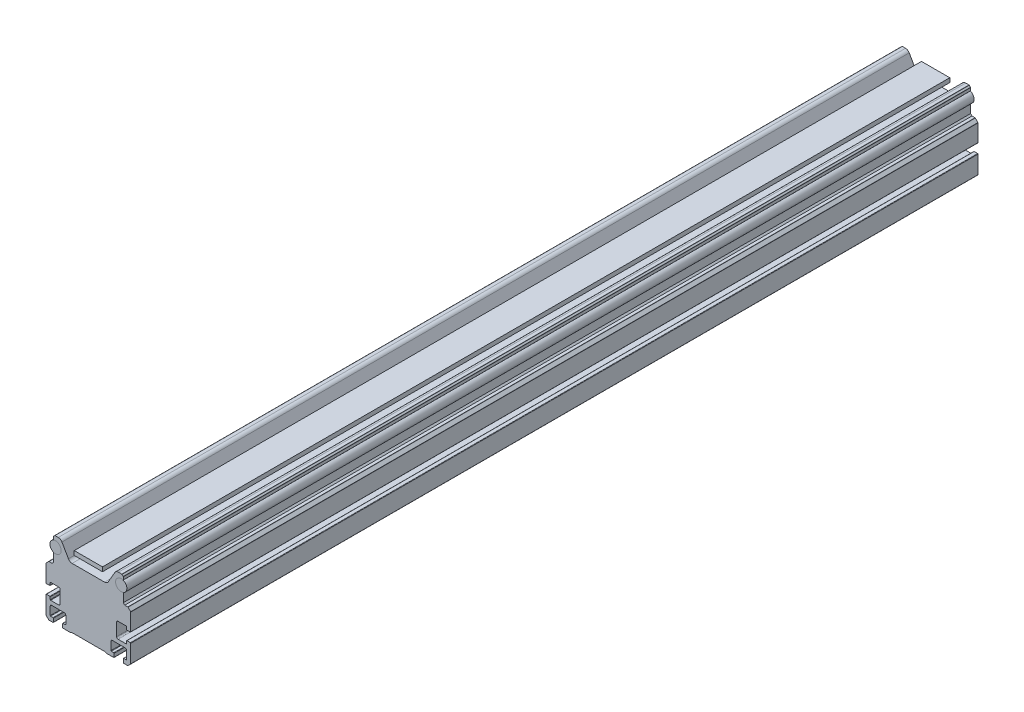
from build123d import *

# Parameters (mm, degrees)
EXTRUDE_1_DEPTH     = 600
SKETCH_1_W          = 20
SKETCH_1_H          = 3
EXTRUDE_1_2_DEPTH   = 600
SKETCH_2_W          = 45.499999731
SKETCH_2_H          = 14.250000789
SKETCH_2_W_2        = 28.000000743
SKETCH_2_H_2        = 22.250001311
CUT_EXTRUDE_1_DEPTH = 645.974738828
SKETCH_3_R          = 4
CUT_EXTRUDE_2_DEPTH = 645.974738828
SKETCH_4_W          = 55.999998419
SKETCH_4_H          = 7.249997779
SKETCH_4_W_2        = 36.000000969
SKETCH_4_H_2        = 12.750001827
CUT_EXTRUDE_3_DEPTH = 645.974738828
FILLET_1_R          = 3
FILLET_2_R          = 2
FILLET_3_R          = 1
SKETCH_5_W          = 7
SKETCH_5_H          = 5.7
SKETCH_5_W_2        = 6.5
SKETCH_5_H_2        = 6
EXTRUDE_2_DEPTH     = 600
SKETCH_6_R          = 2.1
CUT_EXTRUDE_4_DEPTH = 645.974738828
CUT_EXTRUDE_5_DEPTH = 645.974738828
FILLET_4_R          = 2
FILLET_5_R          = 0.5
SKETCH_8_R          = 4
EXTRUDE_3_DEPTH     = 600
EXTRUDE_3_2_DEPTH   = 600
EXTRUDE_4_DEPTH     = 600


with BuildPart() as part:
    # Sketch 1 → Extrude 1 (new body)
    with BuildSketch(Plane.XY):
        with BuildLine():
            Line((145.211893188, 91.381442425), (168.963364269, 91.381442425))
            ThreePointArc((168.963364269, 91.381442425), (169.078169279, 91.358606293), (169.175496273, 91.29357449))
            Line((169.175496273, 91.29357449), (169.499760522, 90.969310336))
            ThreePointArc((169.499760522, 90.969310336), (169.597087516, 90.904278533), (169.711892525, 90.881442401))
            Line((169.711892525, 90.881442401), (175.03762846, 90.881442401))
            ThreePointArc((175.03762846, 90.881442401), (175.249760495, 90.969310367), (175.33762846, 91.181442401))
            Line((175.33762846, 91.181442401), (175.33762846, 93.581442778))
            ThreePointArc((175.33762846, 93.581442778), (175.249760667, 93.79357499), (175.037628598, 93.881443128))
            Line((175.037628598, 93.881443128), (173.387629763, 93.881443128))
            ThreePointArc((173.387629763, 93.881443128), (173.175497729, 93.969311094), (173.087629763, 94.181443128))
            Line((173.087629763, 94.181443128), (173.087629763, 99.881442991))
            ThreePointArc((173.087629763, 99.881442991), (173.380522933, 100.588549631), (174.087629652, 100.881442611))
            Line((174.087629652, 100.881442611), (183.087629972, 100.881442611))
            ThreePointArc((183.087629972, 100.881442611), (183.794736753, 100.588549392), (184.087629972, 99.881442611))
            Line((184.087629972, 99.881442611), (184.087629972, 94.18144286))
            ThreePointArc((184.087629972, 94.18144286), (183.999762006, 93.969310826), (183.787629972, 93.88144286))
            Line((183.787629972, 93.88144286), (182.137629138, 93.88144286))
            ThreePointArc((182.137629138, 93.88144286), (181.925497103, 93.793574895), (181.837629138, 93.58144286))
            Line((181.837629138, 93.58144286), (181.837629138, 91.181442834))
            ThreePointArc((181.837629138, 91.181442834), (181.925497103, 90.9693108), (182.137629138, 90.881442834))
            Line((182.137629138, 90.881442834), (184.963364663, 90.881442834))
            ThreePointArc((184.963364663, 90.881442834), (185.078169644, 90.904278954), (185.175496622, 90.969310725))
            Line((185.175496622, 90.969310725), (186.999760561, 92.793573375))
            ThreePointArc((186.999760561, 92.793573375), (187.064792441, 92.890900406), (187.087628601, 93.005705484))
            Line((187.087628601, 93.005705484), (187.087628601, 105.581442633))
            ThreePointArc((187.087628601, 105.581442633), (186.999760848, 105.793574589), (186.787629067, 105.881442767))
            Line((186.787629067, 105.881442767), (184.387630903, 105.881442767))
            ThreePointArc((184.387630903, 105.881442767), (184.175498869, 105.793574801), (184.087630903, 105.581442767))
            Line((184.087630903, 105.581442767), (184.087630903, 103.931442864))
            ThreePointArc((184.087630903, 103.931442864), (183.999762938, 103.71931083), (183.787630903, 103.631442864))
            Line((183.787630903, 103.631442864), (178.087629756, 103.631442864))
            ThreePointArc((178.087629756, 103.631442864), (177.380522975, 103.924336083), (177.087629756, 104.631442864))
            Line((177.087629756, 104.631442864), (177.087629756, 113.63144305))
            ThreePointArc((177.087629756, 113.63144305), (177.380522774, 114.338550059), (178.08762951, 114.631443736))
            Line((178.08762951, 114.631443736), (183.787629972, 114.631443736))
            ThreePointArc((183.787629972, 114.631443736), (183.999762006, 114.54357577), (184.087629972, 114.331443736))
            Line((184.087629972, 114.331443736), (184.087629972, 112.681444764))
            ThreePointArc((184.087629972, 112.681444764), (184.175497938, 112.46931273), (184.387629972, 112.381444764))
            Line((184.387629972, 112.381444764), (186.787628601, 112.381444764))
            ThreePointArc((186.787628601, 112.381444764), (186.999760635, 112.46931273), (187.087628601, 112.681444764))
            Line((187.087628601, 112.681444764), (187.087628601, 124.757179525))
            ThreePointArc((187.087628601, 124.757179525), (187.064792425, 124.871984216), (186.999760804, 124.969310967))
            Line((186.999760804, 124.969310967), (185.175500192, 126.793573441))
            ThreePointArc((185.175500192, 126.793573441), (185.07817315, 126.858605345), (184.96336805, 126.881441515))
            Line((184.96336805, 126.881441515), (182.837631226, 126.881441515))
            Line((182.837631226, 126.881441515), (181.837629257, 127.881445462))
            Line((181.837629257, 127.881445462), (181.837629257, 133.887697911))
            ThreePointArc((181.837629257, 133.887697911), (181.75514319, 134.049532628), (181.575724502, 134.077876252))
            ThreePointArc((181.575724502, 134.077876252), (184.337629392, 137.881443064), (181.575724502, 141.685009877))
            ThreePointArc((181.575724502, 141.685009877), (181.75514319, 141.713353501), (181.837629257, 141.875188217))
            Line((181.837629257, 141.875188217), (181.837629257, 143.75717837))
            ThreePointArc((181.837629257, 143.75717837), (181.814793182, 143.871983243), (181.749761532, 143.969310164))
            Line((181.749761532, 143.969310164), (180.925497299, 144.79357626))
            ThreePointArc((180.925497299, 144.79357626), (180.828170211, 144.85860826), (180.713365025, 144.881444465))
            Line((180.713365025, 144.881444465), (178.402586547, 144.881444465))
            ThreePointArc((178.402586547, 144.881444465), (176.902586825, 144.479520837), (175.804510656, 143.38144502))
            Line((175.804510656, 143.38144502), (171.185705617, 135.381443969))
            ThreePointArc((171.185705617, 135.381443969), (170.087629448, 134.283368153), (168.587629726, 133.881444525))
            Line((168.587629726, 133.881444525), (145.587629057, 133.881444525))
            ThreePointArc((145.587629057, 133.881444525), (144.087629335, 134.283368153), (142.989553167, 135.381443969))
            Line((142.989553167, 135.381443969), (138.370748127, 143.38144502))
            ThreePointArc((138.370748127, 143.38144502), (137.272671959, 144.479520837), (135.772672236, 144.881444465))
            Line((135.772672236, 144.881444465), (133.461893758, 144.881444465))
            ThreePointArc((133.461893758, 144.881444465), (133.347088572, 144.85860826), (133.249761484, 144.79357626))
            Line((133.249761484, 144.79357626), (132.425497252, 143.969310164))
            ThreePointArc((132.425497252, 143.969310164), (132.360465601, 143.871983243), (132.337629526, 143.75717837))
            Line((132.337629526, 143.75717837), (132.337629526, 141.875188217))
            ThreePointArc((132.337629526, 141.875188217), (132.420115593, 141.713353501), (132.599534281, 141.685009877))
            ThreePointArc((132.599534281, 141.685009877), (129.837629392, 137.881443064), (132.599534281, 134.077876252))
            ThreePointArc((132.599534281, 134.077876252), (132.420115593, 134.049532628), (132.337629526, 133.887697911))
            Line((132.337629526, 133.887697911), (132.337629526, 127.881445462))
            Line((132.337629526, 127.881445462), (131.337627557, 126.881441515))
            Line((131.337627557, 126.881441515), (129.211890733, 126.881441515))
            ThreePointArc((129.211890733, 126.881441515), (129.097085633, 126.858605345), (128.999758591, 126.793573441))
            Line((128.999758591, 126.793573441), (127.175497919, 124.969310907))
            ThreePointArc((127.175497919, 124.969310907), (127.110466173, 124.87198394), (127.087630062, 124.757178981))
            Line((127.087630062, 124.757178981), (127.087630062, 112.681443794))
            ThreePointArc((127.087630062, 112.681443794), (127.175498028, 112.46931176), (127.387630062, 112.381443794))
            Line((127.387630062, 112.381443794), (129.787628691, 112.381443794))
            ThreePointArc((129.787628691, 112.381443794), (129.999760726, 112.46931176), (130.087628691, 112.681443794))
            Line((130.087628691, 112.681443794), (130.087628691, 114.331442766))
            ThreePointArc((130.087628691, 114.331442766), (130.175496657, 114.543574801), (130.387628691, 114.631442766))
            Line((130.387628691, 114.631442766), (136.087629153, 114.631442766))
            ThreePointArc((136.087629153, 114.631442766), (136.794735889, 114.338549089), (137.087628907, 113.631442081))
            Line((137.087628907, 113.631442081), (137.087628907, 104.631441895))
            ThreePointArc((137.087628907, 104.631441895), (136.794735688, 103.924335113), (136.087628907, 103.631441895))
            Line((136.087628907, 103.631441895), (130.38762776, 103.631441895))
            ThreePointArc((130.38762776, 103.631441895), (130.175495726, 103.71930986), (130.08762776, 103.931441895))
            Line((130.08762776, 103.931441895), (130.08762776, 105.581441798))
            ThreePointArc((130.08762776, 105.581441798), (129.999759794, 105.793573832), (129.78762776, 105.881441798))
            Line((129.78762776, 105.881441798), (127.387629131, 105.881441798))
            ThreePointArc((127.387629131, 105.881441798), (127.175497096, 105.793573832), (127.087629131, 105.581441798))
            Line((127.087629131, 105.581441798), (127.087629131, 93.005704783))
            ThreePointArc((127.087629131, 93.005704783), (127.110465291, 92.890899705), (127.175497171, 92.793572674))
            Line((127.175497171, 92.793572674), (128.99976111, 90.969310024))
            ThreePointArc((128.99976111, 90.969310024), (129.097088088, 90.904278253), (129.211893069, 90.881442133))
            Line((129.211893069, 90.881442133), (132.037628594, 90.881442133))
            ThreePointArc((132.037628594, 90.881442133), (132.249760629, 90.969310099), (132.337628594, 91.181442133))
            Line((132.337628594, 91.181442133), (132.337628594, 93.581442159))
            ThreePointArc((132.337628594, 93.581442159), (132.249760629, 93.793574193), (132.037628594, 93.881442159))
            Line((132.037628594, 93.881442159), (130.38762776, 93.881442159))
            ThreePointArc((130.38762776, 93.881442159), (130.175495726, 93.969310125), (130.08762776, 94.181442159))
            Line((130.08762776, 94.181442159), (130.08762776, 99.881441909))
            ThreePointArc((130.08762776, 99.881441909), (130.380520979, 100.588548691), (131.08762776, 100.881441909))
            Line((131.08762776, 100.881441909), (140.08762808, 100.881441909))
            ThreePointArc((140.08762808, 100.881441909), (140.794734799, 100.588548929), (141.087627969, 99.881442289))
            Line((141.087627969, 99.881442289), (141.087627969, 94.181442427))
            ThreePointArc((141.087627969, 94.181442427), (140.999760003, 93.969310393), (140.787627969, 93.881442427))
            Line((140.787627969, 93.881442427), (139.137628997, 93.881442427))
            ThreePointArc((139.137628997, 93.881442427), (138.925496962, 93.793574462), (138.837628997, 93.581442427))
            Line((138.837628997, 93.581442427), (138.837628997, 91.181442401))
            ThreePointArc((138.837628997, 91.181442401), (138.925496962, 90.969310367), (139.137628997, 90.881442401))
            Line((139.137628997, 90.881442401), (144.463364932, 90.881442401))
            ThreePointArc((144.463364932, 90.881442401), (144.578169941, 90.904278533), (144.675496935, 90.969310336))
            Line((144.675496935, 90.969310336), (144.999761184, 91.29357449))
            ThreePointArc((144.999761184, 91.29357449), (145.097088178, 91.358606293), (145.211893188, 91.381442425))
        make_face()
    extrude(amount=EXTRUDE_1_DEPTH)

    # Sketch 2 → Cut-Extrude 1 (cut, through all)
    with BuildSketch(Plane.XY.offset(600)):
        with Locations((157.087629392, 124.756444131)):
            Rectangle(SKETCH_2_W, SKETCH_2_H)
        with Locations((157.087629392, 104.506443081)):
            Rectangle(SKETCH_2_W_2, SKETCH_2_H_2)
    extrude(amount=-CUT_EXTRUDE_1_DEPTH, mode=Mode.SUBTRACT)

    # Sketch 3 → Cut-Extrude 2 (cut, through all)
    with BuildSketch(Plane.XY.offset(600)):
        with Locations((133.837629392, 137.881443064)):
            Circle(SKETCH_3_R)
        with Locations((180.337629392, 137.881443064)):
            Circle(SKETCH_3_R)
    extrude(amount=-CUT_EXTRUDE_2_DEPTH, mode=Mode.SUBTRACT)

    # Sketch 4 → Cut-Extrude 3 (cut, through all)
    with BuildSketch(Plane.XY.offset(600)):
        with Locations((157.087629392, 121.256442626)):
            Rectangle(SKETCH_4_W, SKETCH_4_H)
        with Locations((157.087629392, 109.256442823)):
            Rectangle(SKETCH_4_W_2, SKETCH_4_H_2)
    extrude(amount=-CUT_EXTRUDE_3_DEPTH, mode=Mode.SUBTRACT)

    # Fillet 1
    fillet_1_edges = [part.edges().sort_by_distance(p)[0] for p in [
        (129.087630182, 124.881441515, 300),
        (185.087628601, 124.881441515, 300),
    ]]
    fillet(fillet_1_edges, radius=FILLET_1_R)

    # Fillet 2
    fillet_2_edges = [part.edges().sort_by_distance(p)[0] for p in [
        (185.087628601, 117.631443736, 300),
        (129.087630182, 117.631443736, 300),
        (139.087628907, 115.631443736, 300),
        (175.087629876, 102.881441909, 300),
        (139.087628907, 102.881441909, 300),
        (175.087629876, 115.631443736, 300),
    ]]
    fillet(fillet_2_edges, radius=FILLET_2_R)

    # Fillet 3
    fillet_3_edges = [part.edges().sort_by_distance(p)[0] for p in [
        (179.837629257, 124.881441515, 300),
        (134.337629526, 124.881441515, 300),
        (171.087629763, 102.881441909, 300),
        (143.08762902, 102.881441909, 300),
    ]]
    fillet(fillet_3_edges, radius=FILLET_3_R)

    # Sketch 5 → Extrude 2 (add)
    with BuildSketch(Plane.XY.offset(600)):
        with Locations((137.837629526, 129.031444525)):
            Rectangle(SKETCH_5_W, SKETCH_5_H)
        with Locations((176.337629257, 129.031444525)):
            Rectangle(SKETCH_5_W, SKETCH_5_H)
        with Locations((167.837629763, 96.381442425)):
            Rectangle(SKETCH_5_W_2, SKETCH_5_H_2)
        with Locations((146.33762902, 96.381442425)):
            Rectangle(SKETCH_5_W_2, SKETCH_5_H_2)
    extrude(amount=-EXTRUDE_2_DEPTH)

    # Sketch 6 → Cut-Extrude 4 (cut, through all)
    with BuildSketch(Plane.XY.offset(600)):
        with Locations((137.587629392, 129.881444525)):
            Circle(SKETCH_6_R)
        with Locations(Location((176.587629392, 129.881444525, 0), (0, 0, 180))):
            Circle(SKETCH_6_R)
        with Locations((146.087629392, 95.881442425)):
            Circle(SKETCH_6_R)
        with Locations(Location((168.087629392, 95.881442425, 0), (0, 0, 180))):
            Circle(SKETCH_6_R)
    extrude(amount=-CUT_EXTRUDE_4_DEPTH, mode=Mode.SUBTRACT)

    # Sketch 7 → Cut-Extrude 5 (cut, through all)
    with BuildSketch(Plane.XY.offset(600)):
        Polygon((137.587629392, 129.881444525), (139.493680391, 122.954265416), (144.539767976, 128.068543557), align=None)
        Polygon((169.635490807, 128.068543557), (174.681578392, 122.954265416), (176.587629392, 129.881444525), align=None)
        Polygon((146.087629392, 95.881442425), (148.22864083, 103.871807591), (154.07799433, 98.022454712), align=None)
        Polygon((165.946617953, 103.871807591), (160.097264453, 98.022454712), (168.087629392, 95.881442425), align=None)
    extrude(amount=-CUT_EXTRUDE_5_DEPTH, mode=Mode.SUBTRACT)

    # Fillet 4
    fillet_4_edges = [part.edges().sort_by_distance(p)[0] for p in [
        (172.837629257, 131.881444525, 300),
        (141.337629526, 131.881444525, 300),
        (179.837629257, 126.181444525, 300),
        (134.337629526, 126.181444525, 300),
        (171.087629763, 99.381442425, 300),
        (164.587629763, 93.381442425, 300),
        (149.58762902, 93.381442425, 300),
        (143.08762902, 99.381442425, 300),
    ]]
    fillet(fillet_4_edges, radius=FILLET_4_R)

    # Fillet 5
    fillet_5_edges = [part.edges().sort_by_distance(p)[0] for p in [
        (138.144750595, 127.856693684, 300),
        (139.619675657, 129.35155022, 300),
        (141.337629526, 128.903561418, 300),
        (138.605704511, 126.181444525, 300),
        (174.555583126, 129.35155022, 300),
        (176.030508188, 127.856693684, 300),
        (175.569554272, 126.181444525, 300),
        (172.837629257, 128.903561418, 300),
        (146.631149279, 97.909886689, 300),
        (148.116073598, 96.424962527, 300),
        (149.58762902, 96.819264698, 300),
        (147.025451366, 99.381442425, 300),
        (166.059185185, 96.424962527, 300),
        (167.149807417, 99.381442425, 300),
        (164.587629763, 96.819264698, 300),
    ]]
    fillet(fillet_5_edges, radius=FILLET_5_R)

    # Sketch 9 → Extrude 4 (add)
    with BuildSketch(Plane(origin=(0, 0, 0), x_dir=(-1, 0, 0), z_dir=(0, 0, -1))):
        with BuildLine():
            Line((-141.337629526, 129.550666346), (-141.337629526, 129.881444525))
            ThreePointArc((-141.337629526, 129.881444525), (-141.923415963, 131.295658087), (-143.337629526, 131.881444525))
            Line((-143.337629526, 131.881444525), (-170.837629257, 131.881444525))
            ThreePointArc((-170.837629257, 131.881444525), (-172.25184282, 131.295658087), (-172.837629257, 129.881444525))
            Line((-172.837629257, 129.881444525), (-172.837629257, 129.550666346))
            ThreePointArc((-172.837629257, 129.550666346), (-173.031919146, 129.155013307), (-173.463794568, 129.066845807))
            Line((-173.463794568, 129.066845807), (-174.118722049, 129.237630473))
            ThreePointArc((-174.118722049, 129.237630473), (-174.397432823, 129.428064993), (-174.491609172, 129.752218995))
            ThreePointArc((-174.491609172, 129.752218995), (-178.082485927, 131.356369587), (-176.430282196, 127.787347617))
            ThreePointArc((-176.430282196, 127.787347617), (-176.104893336, 127.697530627), (-175.910735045, 127.42140102))
            Line((-175.910735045, 127.42140102), (-175.743630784, 126.81409243))
            ThreePointArc((-175.743630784, 126.81409243), (-175.828018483, 126.378396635), (-176.225714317, 126.181444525))
            Line((-176.225714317, 126.181444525), (-178.365785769, 126.181444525))
            ThreePointArc((-178.365785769, 126.181444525), (-179.296736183, 125.951566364), (-180.013681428, 125.314775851))
            ThreePointArc((-180.013681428, 125.314775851), (-180.37215405, 124.996380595), (-180.837629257, 124.881441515))
            Line((-180.837629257, 124.881441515), (-182.087628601, 124.881441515))
            ThreePointArc((-182.087628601, 124.881441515), (-184.208948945, 124.002761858), (-185.087628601, 121.881441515))
            Line((-185.087628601, 121.881441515), (-185.087628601, 119.631443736))
            ThreePointArc((-185.087628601, 119.631443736), (-184.501842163, 118.217230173), (-183.087628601, 117.631443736))
            Line((-183.087628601, 117.631443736), (-131.087630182, 117.631443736))
            ThreePointArc((-131.087630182, 117.631443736), (-129.67341662, 118.217230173), (-129.087630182, 119.631443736))
            Line((-129.087630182, 119.631443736), (-129.087630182, 121.881441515))
            ThreePointArc((-129.087630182, 121.881441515), (-129.966309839, 124.002761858), (-132.087630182, 124.881441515))
            Line((-132.087630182, 124.881441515), (-133.337629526, 124.881441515))
            ThreePointArc((-133.337629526, 124.881441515), (-133.803104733, 124.996380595), (-134.161577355, 125.314775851))
            ThreePointArc((-134.161577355, 125.314775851), (-134.878522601, 125.951566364), (-135.809473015, 126.181444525))
            Line((-135.809473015, 126.181444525), (-137.949544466, 126.181444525))
            ThreePointArc((-137.949544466, 126.181444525), (-138.3472403, 126.378396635), (-138.431628, 126.81409243))
            Line((-138.431628, 126.81409243), (-138.264523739, 127.42140102))
            ThreePointArc((-138.264523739, 127.42140102), (-138.070365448, 127.697530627), (-137.744976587, 127.787347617))
            ThreePointArc((-137.744976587, 127.787347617), (-136.092772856, 131.356369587), (-139.683649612, 129.752218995))
            ThreePointArc((-139.683649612, 129.752218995), (-139.77782596, 129.428064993), (-140.056536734, 129.237630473))
            Line((-140.056536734, 129.237630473), (-140.711464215, 129.066845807))
            ThreePointArc((-140.711464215, 129.066845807), (-141.143339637, 129.155013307), (-141.337629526, 129.550666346))
        make_face()
        with BuildLine():
            Line((-165.6230985, 96.541811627), (-165.217039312, 96.650614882))
            ThreePointArc((-165.217039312, 96.650614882), (-164.783249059, 96.564328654), (-164.587629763, 96.167651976))
            Line((-164.587629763, 96.167651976), (-164.587629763, 95.381442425))
            ThreePointArc((-164.587629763, 95.381442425), (-164.001843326, 93.967228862), (-162.587629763, 93.381442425))
            Line((-162.587629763, 93.381442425), (-151.58762902, 93.381442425))
            ThreePointArc((-151.58762902, 93.381442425), (-150.173415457, 93.967228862), (-149.58762902, 95.381442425))
            Line((-149.58762902, 95.381442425), (-149.58762902, 96.167651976))
            ThreePointArc((-149.58762902, 96.167651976), (-149.392009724, 96.564328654), (-148.958219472, 96.650614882))
            Line((-148.958219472, 96.650614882), (-148.552160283, 96.541811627))
            ThreePointArc((-148.552160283, 96.541811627), (-148.274733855, 96.349510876), (-148.182735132, 96.024732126))
            ThreePointArc((-148.182735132, 96.024732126), (-144.60270523, 94.396518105), (-146.23091887, 97.97654818))
            ThreePointArc((-146.23091887, 97.97654818), (-146.555697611, 98.068546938), (-146.747998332, 98.345973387))
            Line((-146.747998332, 98.345973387), (-146.856801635, 98.752032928))
            ThreePointArc((-146.856801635, 98.752032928), (-146.770515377, 99.18582315), (-146.373838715, 99.381442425))
            Line((-146.373838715, 99.381442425), (-145.08762902, 99.381442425))
            ThreePointArc((-145.08762902, 99.381442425), (-143.673415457, 99.967228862), (-143.08762902, 101.381442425))
            Line((-143.08762902, 101.381442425), (-143.08762902, 101.881441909))
            ThreePointArc((-143.08762902, 101.881441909), (-142.794735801, 102.588548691), (-142.08762902, 102.881441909))
            Line((-142.08762902, 102.881441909), (-141.087628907, 102.881441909))
            ThreePointArc((-141.087628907, 102.881441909), (-139.673415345, 103.467228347), (-139.087628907, 104.881441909))
            Line((-139.087628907, 104.881441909), (-139.087628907, 113.631443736))
            ThreePointArc((-139.087628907, 113.631443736), (-139.673415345, 115.045657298), (-141.087628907, 115.631443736))
            Line((-141.087628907, 115.631443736), (-173.087629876, 115.631443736))
            ThreePointArc((-173.087629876, 115.631443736), (-174.501843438, 115.045657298), (-175.087629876, 113.631443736))
            Line((-175.087629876, 113.631443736), (-175.087629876, 104.881441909))
            ThreePointArc((-175.087629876, 104.881441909), (-174.501843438, 103.467228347), (-173.087629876, 102.881441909))
            Line((-173.087629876, 102.881441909), (-172.087629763, 102.881441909))
            ThreePointArc((-172.087629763, 102.881441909), (-171.380522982, 102.588548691), (-171.087629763, 101.881441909))
            Line((-171.087629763, 101.881441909), (-171.087629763, 101.381442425))
            ThreePointArc((-171.087629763, 101.381442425), (-170.501843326, 99.967228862), (-169.087629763, 99.381442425))
            Line((-169.087629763, 99.381442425), (-167.801420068, 99.381442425))
            ThreePointArc((-167.801420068, 99.381442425), (-167.404743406, 99.18582315), (-167.318457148, 98.752032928))
            Line((-167.318457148, 98.752032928), (-167.544109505, 97.909886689))
            ThreePointArc((-167.544109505, 97.909886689), (-169.709060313, 94.546915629), (-165.992523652, 96.024732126))
            ThreePointArc((-165.992523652, 96.024732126), (-165.900524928, 96.349510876), (-165.6230985, 96.541811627))
        make_face()
    extrude(amount=-EXTRUDE_4_DEPTH)


with BuildPart() as body_2:
    # Sketch 1 → Extrude 1 2 (new body)
    with BuildSketch(Plane.XY):
        with Locations((157.087628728, 140.991444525)):
            Rectangle(SKETCH_1_W, SKETCH_1_H)
    extrude(amount=EXTRUDE_1_2_DEPTH)


with BuildPart() as body_3:
    # Sketch 8 → Extrude 3 (new body)
    with BuildSketch(Plane(origin=(0, 0, 0), x_dir=(-1, 0, 0), z_dir=(0, 0, -1))):
        with Locations((-180.337629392, 137.881443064)):
            Circle(SKETCH_8_R)
    extrude(amount=-EXTRUDE_3_DEPTH)


with BuildPart() as body_4:
    # Sketch 8 → Extrude 3 2 (new body)
    with BuildSketch(Plane(origin=(0, 0, 0), x_dir=(-1, 0, 0), z_dir=(0, 0, -1))):
        with Locations((-133.837629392, 137.881443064)):
            Circle(SKETCH_8_R)
    extrude(amount=-EXTRUDE_3_2_DEPTH)


solid = Compound([part.part, body_2.part, body_3.part, body_4.part])
